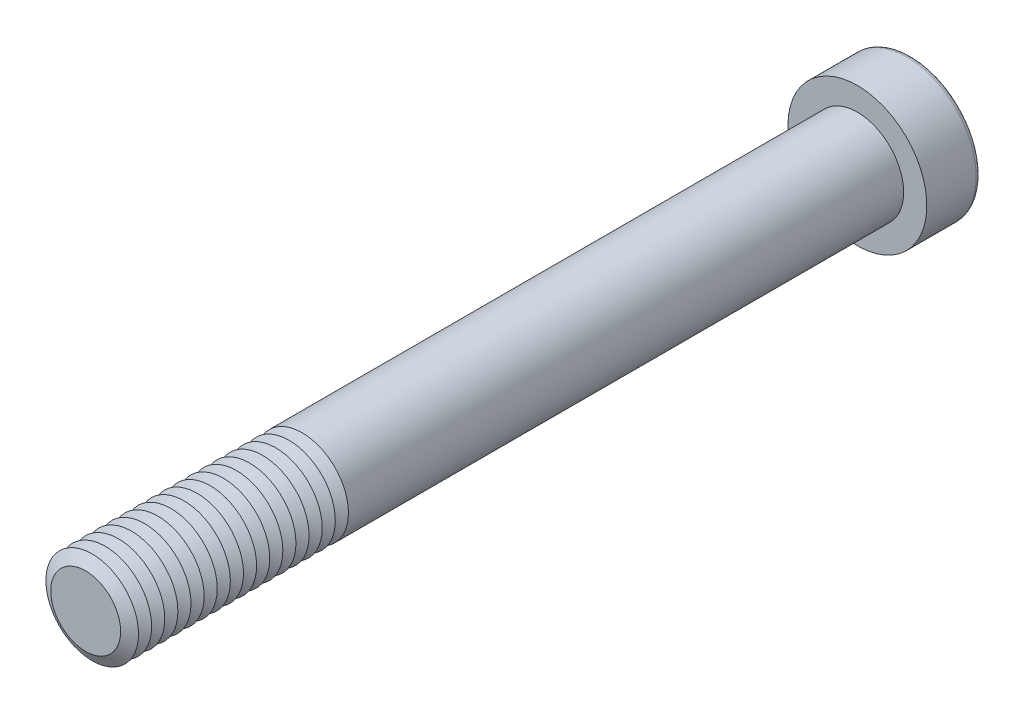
from build123d import *

# Parameters (mm, degrees)
SKETCH1_R           = 6
BOSS_EXTRUDE1_DEPTH = 100
SKETCH2_R           = 9
BOSS_EXTRUDE2_DEPTH = 7
CUT_EXTRUDE1_DEPTH  = 6
FILLET1_R           = 0.6
LPATTERN1_COUNT     = 17
LPATTERN1_PITCH     = 1.7


with BuildPart() as part:
    # Sketch1 → Boss-Extrude1 (new body)
    with BuildSketch(Plane.XY):
        Circle(SKETCH1_R)
    extrude(amount=BOSS_EXTRUDE1_DEPTH)

    # Sketch2 → Boss-Extrude2 (add)
    with BuildSketch(Plane(origin=(0, 0, 0), x_dir=(-1, 0, 0), z_dir=(0, 0, -1))):
        Circle(SKETCH2_R)
    extrude(amount=BOSS_EXTRUDE2_DEPTH)

    # Sketch3 → Cut-Extrude1 (cut)
    with BuildSketch(Plane(origin=(0, 0, -7), x_dir=(-1, 0, 0), z_dir=(0, 0, -1))):
        Polygon((-2.309401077, 4), (-4.618802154, 0), (-2.309401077, -4), (2.309401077, -4), (4.618802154, 0), (2.309401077, 4), align=None)
    extrude(amount=-CUT_EXTRUDE1_DEPTH, mode=Mode.SUBTRACT)

    # Fillet1
    fillet1_edges = [part.edges().sort_by_distance(p)[0] for p in [
        (9, 0, -7),
    ]]
    fillet(fillet1_edges, radius=FILLET1_R)

    # Cut-Extrude2 cone 1 section (on through the dimple's axis) → Cut-Extrude2 (revolve, cut)
    with BuildSketch(Plane(origin=(0, 0, -1), x_dir=(0, 1, 0), z_dir=(1, 0, 0))):
        Polygon((0, 0), (4, 0), (0, 2.309401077), align=None)
    revolve(axis=Axis((0, 0, -1), (0, 0, 1)), mode=Mode.SUBTRACT)

    # Cut-Extrude3 cone 1 section (on through the dimple's axis) → Cut-Extrude3 (revolve, cut)
    with BuildSketch(Plane(origin=(0, 0, -7), x_dir=(0, 1, 0), z_dir=(1, 0, 0))):
        Polygon((0, 0), (4.618802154, 0), (0, 1.237604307), align=None)
    revolve(axis=Axis((0, 0, -7), (0, 0, 1)), mode=Mode.SUBTRACT)

    # Sketch7 → Cut-Revolve1 (revolve, cut)
    with BuildSketch(Plane(origin=(0, 0, 0), x_dir=(0, 0, -1), z_dir=(1, 0, 0)), mode=Mode.PRIVATE) as cut_revolve1_sk:
        Polygon((-100, 4.527756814), (-99.15, 6), (-100.85, 6), align=None)
    cut_revolve1 = revolve(cut_revolve1_sk.sketch.rotate(Axis((0, 0, 100), (0, 0, -1)), 90), axis=Axis((0, 0, 100), (0, 0, -1)), mode=Mode.SUBTRACT)

    # LPattern1: Cut-Revolve1 ×17
    with Locations(*[(0, 0, -i * LPATTERN1_PITCH) for i in range(1, LPATTERN1_COUNT)]):
        add(cut_revolve1, mode=Mode.SUBTRACT)


solid = part.part
